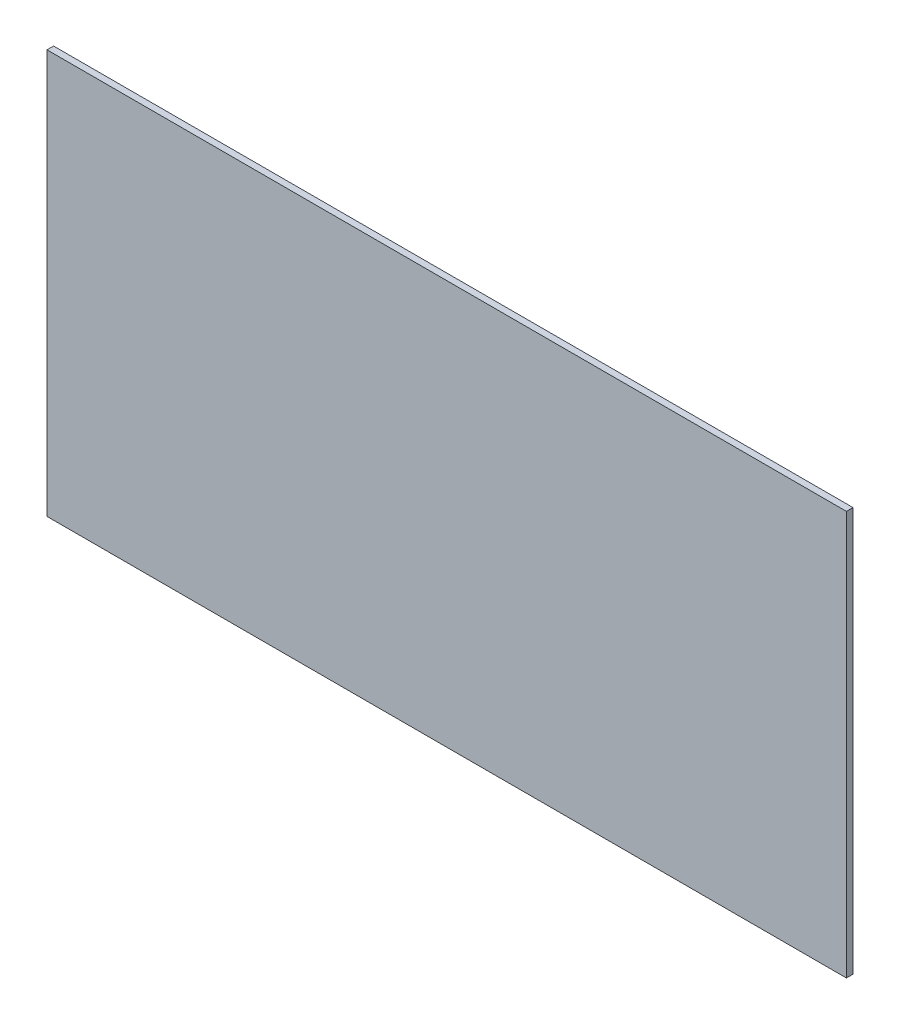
from build123d import *

# Parameters (mm, degrees)
ESQUISSE1_W      = 364
ESQUISSE1_H      = 184
EXTRUSION1_DEPTH = 3


with BuildPart() as part:
    # Esquisse1 → Extrusion1 (new body)
    with BuildSketch(Plane.XY):
        with Locations((182, 92)):
            Rectangle(ESQUISSE1_W, ESQUISSE1_H)
    extrude(amount=EXTRUSION1_DEPTH)


solid = part.part
